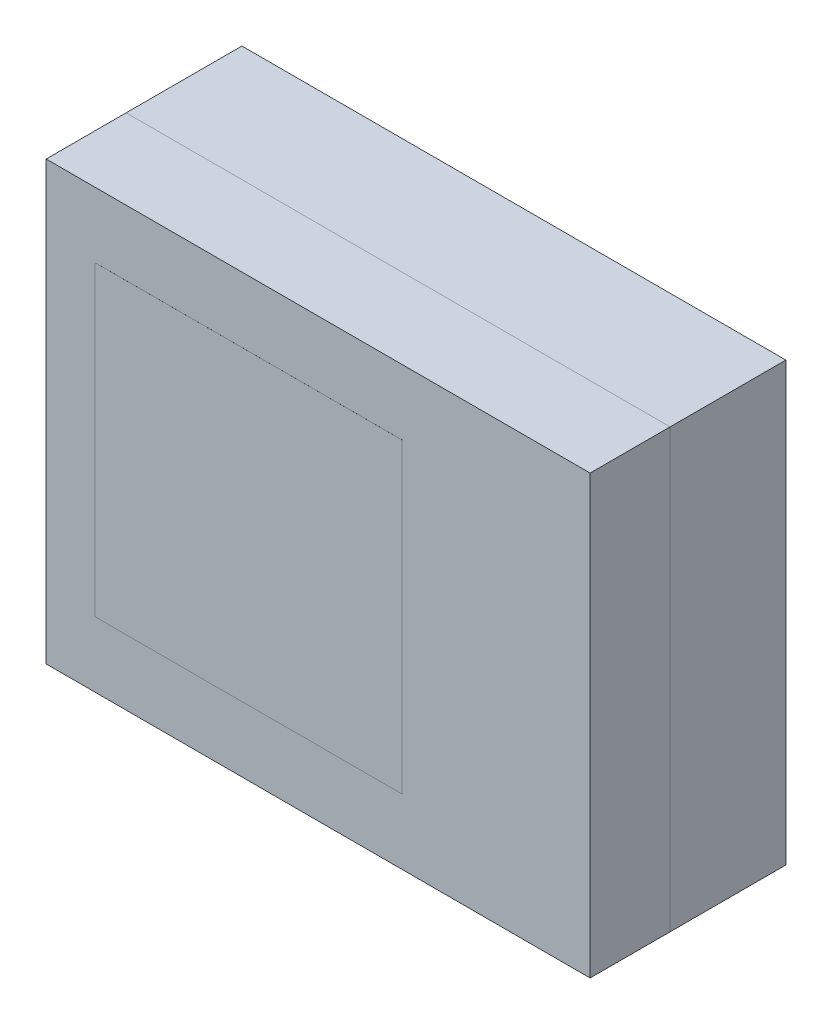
from build123d import *

# Parameters (mm, degrees)
SKETCH_1_W      = 1.15
SKETCH_1_H      = 1.15
EXTRUDE_1_DEPTH = 0.0001
SKETCH_6_W      = 2.04
SKETCH_6_H      = 1.64
EXTRUDE_5_DEPTH = 0.3
SKETCH_7_W      = 2.04
SKETCH_7_H      = 1.64
EXTRUDE_6_DEPTH = 0.434
SKETCH_8_W      = 0.6
SKETCH_8_H      = 1.34
SKETCH_8_W_2    = 0.87
SKETCH_8_H_2    = 0.545
EXTRUDE_7_DEPTH = 0.056


with BuildPart() as part:
    # Sketch 1 → Extrude 1 (new body)
    with BuildSketch(Plane.XY):
        Rectangle(SKETCH_1_W, SKETCH_1_H)
    extrude(amount=EXTRUDE_1_DEPTH)


with BuildPart() as body_2:
    # Sketch 6 → Extrude 5 (new body)
    with BuildSketch(Plane(origin=(0, 0, 0), x_dir=(-1, 0, 0), z_dir=(0, 0, -1))):
        with Locations((-0.261, 0)):
            Rectangle(SKETCH_6_W, SKETCH_6_H)
    extrude(amount=EXTRUDE_5_DEPTH)


with BuildPart() as body_3:
    # Sketch 7 → Extrude 6 (new body)
    with BuildSketch(Plane(origin=(0, 0, -0.3), x_dir=(-1, 0, 0), z_dir=(0, 0, -1))):
        with Locations((-0.261, 0)):
            Rectangle(SKETCH_7_W, SKETCH_7_H)
    extrude(amount=EXTRUDE_6_DEPTH)

    # Sketch 8 → Extrude 7 (add)
    with BuildSketch(Plane(origin=(0, 0, -0.734), x_dir=(-1, 0, 0), z_dir=(0, 0, -1))):
        with Locations((0.309, 0)):
            Rectangle(SKETCH_8_W, SKETCH_8_H)
        with Locations((-0.696, 0.3975)):
            Rectangle(SKETCH_8_W_2, SKETCH_8_H_2)
        with Locations((-0.696, -0.3975)):
            Rectangle(SKETCH_8_W_2, SKETCH_8_H_2)
    extrude(amount=EXTRUDE_7_DEPTH)


solid = Compound([part.part, body_2.part, body_3.part])
